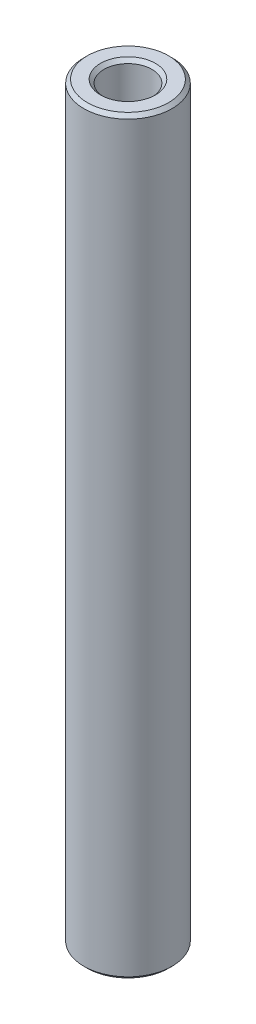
ISO-10303-21;
HEADER;
FILE_DESCRIPTION(('STEP AP214'),'2;1');
FILE_NAME('part.step','',(''),(''),'','','');
FILE_SCHEMA(('AUTOMOTIVE_DESIGN { 1 0 10303 214 1 1 1 1 }'));
ENDSEC;
DATA;
#1=APPLICATION_CONTEXT('core data for automotive mechanical design processes');
#2=APPLICATION_PROTOCOL_DEFINITION('international standard','automotive_design',2000,#1);
#3=PRODUCT_CONTEXT('',#1,'mechanical');
#4=PRODUCT('Part','Part','',(#3));
#5=PRODUCT_RELATED_PRODUCT_CATEGORY('part','',(#4));
#6=PRODUCT_DEFINITION_FORMATION('','',#4);
#7=PRODUCT_DEFINITION_CONTEXT('part definition',#1,'design');
#8=PRODUCT_DEFINITION('design','',#6,#7);
#9=PRODUCT_DEFINITION_SHAPE('','',#8);
#10=(LENGTH_UNIT() NAMED_UNIT(*) SI_UNIT(.MILLI.,.METRE.));
#11=(NAMED_UNIT(*) PLANE_ANGLE_UNIT() SI_UNIT($,.RADIAN.));
#12=(NAMED_UNIT(*) SI_UNIT($,.STERADIAN.) SOLID_ANGLE_UNIT());
#13=UNCERTAINTY_MEASURE_WITH_UNIT(LENGTH_MEASURE(1.E-05),#10,'distance_accuracy_value','');
#14=(GEOMETRIC_REPRESENTATION_CONTEXT(3) GLOBAL_UNCERTAINTY_ASSIGNED_CONTEXT((#13)) GLOBAL_UNIT_ASSIGNED_CONTEXT((#10,
#11,#12)) REPRESENTATION_CONTEXT('',''));
#15=CARTESIAN_POINT('',(0.,0.,0.));
#16=DIRECTION('',(0.,0.,1.));
#17=DIRECTION('',(1.,0.,0.));
#18=AXIS2_PLACEMENT_3D('',#15,#16,#17);
#19=CARTESIAN_POINT('',(0.,53.975,0.));
#20=DIRECTION('',(0.,-1.,0.));
#21=DIRECTION('',(0.,0.,-1.));
#22=AXIS2_PLACEMENT_3D('',#19,#20,#21);
#23=CYLINDRICAL_SURFACE('',#22,3.175);
#24=CARTESIAN_POINT('',(0.,0.25,0.));
#25=DIRECTION('',(0.,1.,0.));
#26=DIRECTION('',(0.,0.,1.));
#27=AXIS2_PLACEMENT_3D('',#24,#25,#26);
#28=CIRCLE('',#27,3.175);
#29=CARTESIAN_POINT('',(0.,0.25,3.175));
#30=VERTEX_POINT('',#29);
#31=EDGE_CURVE('E50',#30,#30,#28,.T.);
#32=ORIENTED_EDGE('',*,*,#31,.T.);
#33=EDGE_LOOP('',(#32));
#34=FACE_BOUND('',#33,.T.);
#35=CARTESIAN_POINT('',(0.,53.725,0.));
#36=DIRECTION('',(0.,1.,0.));
#37=DIRECTION('',(0.,0.,1.));
#38=AXIS2_PLACEMENT_3D('',#35,#36,#37);
#39=CIRCLE('',#38,3.175);
#40=CARTESIAN_POINT('',(0.,53.725,3.175));
#41=VERTEX_POINT('',#40);
#42=EDGE_CURVE('E53',#41,#41,#39,.F.);
#43=ORIENTED_EDGE('',*,*,#42,.T.);
#44=EDGE_LOOP('',(#43));
#45=FACE_BOUND('',#44,.T.);
#46=ADVANCED_FACE('F30',(#34,#45),#23,.T.);
#47=CARTESIAN_POINT('',(0.,53.975,0.));
#48=DIRECTION('',(0.,1.,0.));
#49=DIRECTION('',(0.,0.,1.));
#50=AXIS2_PLACEMENT_3D('',#47,#48,#49);
#51=PLANE('',#50);
#52=CARTESIAN_POINT('',(0.,53.975,0.));
#53=DIRECTION('',(0.,1.,0.));
#54=DIRECTION('',(0.,0.,1.));
#55=AXIS2_PLACEMENT_3D('',#52,#53,#54);
#56=CIRCLE('',#55,2.925);
#57=CARTESIAN_POINT('',(0.,53.975,2.925));
#58=VERTEX_POINT('',#57);
#59=EDGE_CURVE('E37',#58,#58,#56,.T.);
#60=ORIENTED_EDGE('',*,*,#59,.T.);
#61=EDGE_LOOP('',(#60));
#62=FACE_BOUND('',#61,.T.);
#63=CARTESIAN_POINT('',(0.,53.975,0.));
#64=DIRECTION('',(0.,1.,0.));
#65=DIRECTION('',(0.,0.,1.));
#66=AXIS2_PLACEMENT_3D('',#63,#64,#65);
#67=CIRCLE('',#66,1.97719999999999);
#68=CARTESIAN_POINT('',(0.,53.975,1.97719999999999));
#69=VERTEX_POINT('',#68);
#70=EDGE_CURVE('E41',#69,#69,#67,.F.);
#71=ORIENTED_EDGE('',*,*,#70,.T.);
#72=EDGE_LOOP('',(#71));
#73=FACE_BOUND('',#72,.T.);
#74=ADVANCED_FACE('F72',(#62,#73),#51,.T.);
#75=CARTESIAN_POINT('',(0.,0.,0.));
#76=DIRECTION('',(0.,1.,0.));
#77=DIRECTION('',(0.,0.,1.));
#78=AXIS2_PLACEMENT_3D('',#75,#76,#77);
#79=PLANE('',#78);
#80=CARTESIAN_POINT('',(0.,0.,0.));
#81=DIRECTION('',(0.,1.,0.));
#82=DIRECTION('',(0.,0.,1.));
#83=AXIS2_PLACEMENT_3D('',#80,#81,#82);
#84=CIRCLE('',#83,2.925);
#85=CARTESIAN_POINT('',(0.,0.,2.925));
#86=VERTEX_POINT('',#85);
#87=EDGE_CURVE('E45',#86,#86,#84,.F.);
#88=ORIENTED_EDGE('',*,*,#87,.T.);
#89=EDGE_LOOP('',(#88));
#90=FACE_BOUND('',#89,.T.);
#91=ADVANCED_FACE('F64',(#90),#79,.F.);
#92=CARTESIAN_POINT('',(0.,22.225,0.));
#93=DIRECTION('',(0.,1.,0.));
#94=DIRECTION('',(0.,0.,1.));
#95=AXIS2_PLACEMENT_3D('',#92,#93,#94);
#96=CYLINDRICAL_SURFACE('',#95,1.7272);
#97=CARTESIAN_POINT('',(0.,53.725,0.));
#98=DIRECTION('',(0.,1.,0.));
#99=DIRECTION('',(0.,0.,1.));
#100=AXIS2_PLACEMENT_3D('',#97,#98,#99);
#101=CIRCLE('',#100,1.7272);
#102=CARTESIAN_POINT('',(0.,53.725,1.7272));
#103=VERTEX_POINT('',#102);
#104=EDGE_CURVE('E10',#103,#103,#101,.T.);
#105=ORIENTED_EDGE('',*,*,#104,.T.);
#106=EDGE_LOOP('',(#105));
#107=FACE_BOUND('',#106,.T.);
#108=CARTESIAN_POINT('',(0.,22.225,0.));
#109=DIRECTION('',(0.,1.,0.));
#110=DIRECTION('',(0.,0.,1.));
#111=AXIS2_PLACEMENT_3D('',#108,#109,#110);
#112=CIRCLE('',#111,1.7272);
#113=CARTESIAN_POINT('',(0.,22.225,1.7272));
#114=VERTEX_POINT('',#113);
#115=EDGE_CURVE('E56',#114,#114,#112,.T.);
#116=ORIENTED_EDGE('',*,*,#115,.F.);
#117=EDGE_LOOP('',(#116));
#118=FACE_BOUND('',#117,.T.);
#119=ADVANCED_FACE('F62',(#107,#118),#96,.F.);
#120=CARTESIAN_POINT('',(0.,22.225,0.));
#121=DIRECTION('',(0.,1.,0.));
#122=DIRECTION('',(0.,0.,1.));
#123=AXIS2_PLACEMENT_3D('',#120,#121,#122);
#124=PLANE('',#123);
#125=ORIENTED_EDGE('',*,*,#115,.T.);
#126=EDGE_LOOP('',(#125));
#127=FACE_BOUND('',#126,.T.);
#128=ADVANCED_FACE('F60',(#127),#124,.T.);
#129=CARTESIAN_POINT('',(0.,0.25,0.));
#130=DIRECTION('',(0.,1.,0.));
#131=DIRECTION('',(0.,0.,1.));
#132=AXIS2_PLACEMENT_3D('',#129,#130,#131);
#133=CONICAL_SURFACE('',#132,3.175,0.785398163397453);
#134=ORIENTED_EDGE('',*,*,#87,.F.);
#135=EDGE_LOOP('',(#134));
#136=FACE_BOUND('',#135,.T.);
#137=ORIENTED_EDGE('',*,*,#31,.F.);
#138=EDGE_LOOP('',(#137));
#139=FACE_BOUND('',#138,.T.);
#140=ADVANCED_FACE('F70',(#136,#139),#133,.T.);
#141=CARTESIAN_POINT('',(0.,53.975,0.));
#142=DIRECTION('',(0.,-1.,0.));
#143=DIRECTION('',(0.,0.,-1.));
#144=AXIS2_PLACEMENT_3D('',#141,#142,#143);
#145=CONICAL_SURFACE('',#144,2.925,0.78539816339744);
#146=ORIENTED_EDGE('',*,*,#42,.F.);
#147=EDGE_LOOP('',(#146));
#148=FACE_BOUND('',#147,.T.);
#149=ORIENTED_EDGE('',*,*,#59,.F.);
#150=EDGE_LOOP('',(#149));
#151=FACE_BOUND('',#150,.T.);
#152=ADVANCED_FACE('F85',(#148,#151),#145,.T.);
#153=CARTESIAN_POINT('',(0.,53.725,0.));
#154=DIRECTION('',(0.,1.,0.));
#155=DIRECTION('',(0.,0.,1.));
#156=AXIS2_PLACEMENT_3D('',#153,#154,#155);
#157=CONICAL_SURFACE('',#156,1.7272,0.785398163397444);
#158=ORIENTED_EDGE('',*,*,#70,.F.);
#159=EDGE_LOOP('',(#158));
#160=FACE_BOUND('',#159,.T.);
#161=ORIENTED_EDGE('',*,*,#104,.F.);
#162=EDGE_LOOP('',(#161));
#163=FACE_BOUND('',#162,.T.);
#164=ADVANCED_FACE('F32',(#160,#163),#157,.F.);
#165=CLOSED_SHELL('',(#46,#74,#91,#119,#128,#140,#152,#164));
#166=MANIFOLD_SOLID_BREP('B2',#165);
#167=ADVANCED_BREP_SHAPE_REPRESENTATION('',(#18,#166),#14);
#168=SHAPE_DEFINITION_REPRESENTATION(#9,#167);
ENDSEC;
END-ISO-10303-21;
